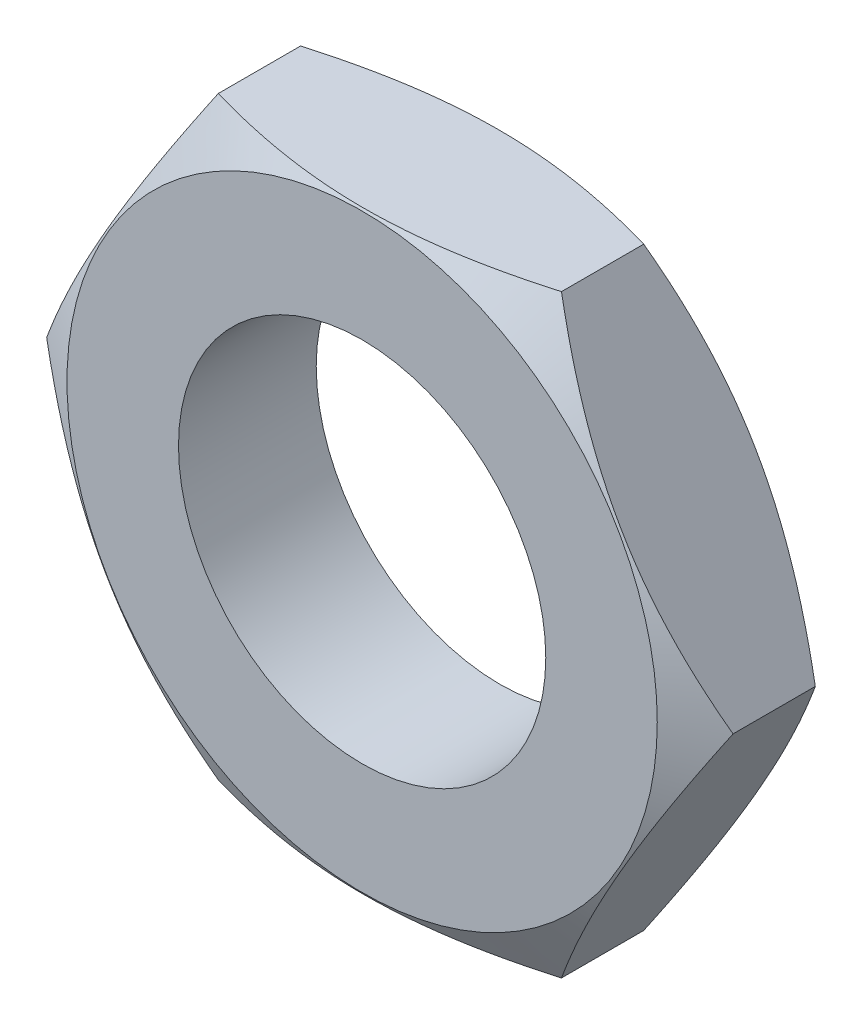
ISO-10303-21;
HEADER;
FILE_DESCRIPTION(('STEP AP214'),'2;1');
FILE_NAME('part.step','',(''),(''),'','','');
FILE_SCHEMA(('AUTOMOTIVE_DESIGN { 1 0 10303 214 1 1 1 1 }'));
ENDSEC;
DATA;
#1=APPLICATION_CONTEXT('core data for automotive mechanical design processes');
#2=APPLICATION_PROTOCOL_DEFINITION('international standard','automotive_design',2000,#1);
#3=PRODUCT_CONTEXT('',#1,'mechanical');
#4=PRODUCT('Part','Part','',(#3));
#5=PRODUCT_RELATED_PRODUCT_CATEGORY('part','',(#4));
#6=PRODUCT_DEFINITION_FORMATION('','',#4);
#7=PRODUCT_DEFINITION_CONTEXT('part definition',#1,'design');
#8=PRODUCT_DEFINITION('design','',#6,#7);
#9=PRODUCT_DEFINITION_SHAPE('','',#8);
#10=(LENGTH_UNIT() NAMED_UNIT(*) SI_UNIT(.MILLI.,.METRE.));
#11=(NAMED_UNIT(*) PLANE_ANGLE_UNIT() SI_UNIT($,.RADIAN.));
#12=(NAMED_UNIT(*) SI_UNIT($,.STERADIAN.) SOLID_ANGLE_UNIT());
#13=UNCERTAINTY_MEASURE_WITH_UNIT(LENGTH_MEASURE(1.E-05),#10,'distance_accuracy_value','');
#14=(GEOMETRIC_REPRESENTATION_CONTEXT(3) GLOBAL_UNCERTAINTY_ASSIGNED_CONTEXT((#13)) GLOBAL_UNIT_ASSIGNED_CONTEXT((#10,
#11,#12)) REPRESENTATION_CONTEXT('',''));
#15=CARTESIAN_POINT('',(0.,0.,0.));
#16=DIRECTION('',(0.,0.,1.));
#17=DIRECTION('',(1.,0.,0.));
#18=AXIS2_PLACEMENT_3D('',#15,#16,#17);
#19=CARTESIAN_POINT('',(0.,0.,0.604197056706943));
#20=DIRECTION('',(0.,0.,1.));
#21=DIRECTION('',(1.,0.,0.));
#22=AXIS2_PLACEMENT_3D('',#19,#20,#21);
#23=CONICAL_SURFACE('',#22,7.475,1.0471975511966);
#24=CARTESIAN_POINT('',(0.,0.,0.));
#25=DIRECTION('',(0.,0.,1.));
#26=DIRECTION('',(1.,0.,0.));
#27=AXIS2_PLACEMENT_3D('',#24,#25,#26);
#28=CIRCLE('',#27,6.4285);
#29=CARTESIAN_POINT('',(6.4285,0.,0.));
#30=VERTEX_POINT('',#29);
#31=EDGE_CURVE('E214',#30,#30,#28,.F.);
#32=ORIENTED_EDGE('',*,*,#31,.F.);
#33=EDGE_LOOP('',(#32));
#34=FACE_BOUND('',#33,.T.);
#35=CARTESIAN_POINT('',(3.73738452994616,6.47373989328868,0.604263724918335));
#36=CARTESIAN_POINT('',(3.8195390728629,6.33144405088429,0.556838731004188));
#37=CARTESIAN_POINT('',(3.90199992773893,6.18861766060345,0.511566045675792));
#38=CARTESIAN_POINT('',(4.06759130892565,5.90180497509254,0.425918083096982));
#39=CARTESIAN_POINT('',(4.15072210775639,5.75781820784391,0.38554491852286));
#40=CARTESIAN_POINT('',(4.40144553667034,5.32355249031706,0.272567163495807));
#41=CARTESIAN_POINT('',(4.57002785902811,5.03155934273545,0.208306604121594));
#42=CARTESIAN_POINT('',(4.82230823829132,4.59459690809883,0.132953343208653));
#43=CARTESIAN_POINT('',(4.90525250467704,4.45093322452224,0.111487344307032));
#44=CARTESIAN_POINT('',(5.07151582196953,4.16295671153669,0.0754919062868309));
#45=CARTESIAN_POINT('',(5.15483483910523,4.01864394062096,0.060961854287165));
#46=CARTESIAN_POINT('',(5.32161758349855,3.72976775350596,0.0392086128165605));
#47=CARTESIAN_POINT('',(5.40508103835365,3.58520480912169,0.0319771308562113));
#48=CARTESIAN_POINT('',(5.57208044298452,3.29595335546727,0.0249683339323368));
#49=CARTESIAN_POINT('',(5.65561639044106,3.15126485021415,0.0251907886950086));
#50=CARTESIAN_POINT('',(5.88447837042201,2.75486427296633,0.0360461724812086));
#51=CARTESIAN_POINT('',(6.02972948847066,2.50328195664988,0.0542700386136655));
#52=CARTESIAN_POINT('',(6.31926697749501,2.00178831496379,0.112058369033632));
#53=CARTESIAN_POINT('',(6.46355233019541,1.7518787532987,0.151642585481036));
#54=CARTESIAN_POINT('',(6.75367252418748,1.2493758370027,0.250591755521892));
#55=CARTESIAN_POINT('',(6.89947075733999,0.996845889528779,0.310375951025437));
#56=CARTESIAN_POINT('',(7.18889294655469,0.495551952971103,0.446061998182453));
#57=CARTESIAN_POINT('',(7.33252060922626,0.246781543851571,0.521931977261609));
#58=CARTESIAN_POINT('',(7.47511547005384,-0.00019999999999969,0.604263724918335));
#59=B_SPLINE_CURVE_WITH_KNOTS('',3,(#35,#36,#37,#38,#39,#40,#41,#42,#43,#44,#45,#46,#47,#48,#49,
#50,#51,#52,#53,#54,#55,#56,#57,#58),.UNSPECIFIED.,.F.,.F.,(4,2,2,2,2,2,2,2,2,2,2,4),(0.,
0.513008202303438,1.02623683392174,2.05482672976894,2.55652445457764,3.05817783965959,
3.55926061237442,4.06032790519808,4.93263244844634,5.80574500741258,6.69822217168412,
7.58894722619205),.UNSPECIFIED.);
#60=CARTESIAN_POINT('',(3.7375,6.47353989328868,0.604197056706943));
#61=VERTEX_POINT('',#60);
#62=CARTESIAN_POINT('',(7.475,0.,0.604197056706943));
#63=VERTEX_POINT('',#62);
#64=EDGE_CURVE('E90',#61,#63,#59,.T.);
#65=ORIENTED_EDGE('',*,*,#64,.T.);
#66=CARTESIAN_POINT('',(7.47511547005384,0.0002,0.604263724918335));
#67=CARTESIAN_POINT('',(7.3929609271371,-0.142095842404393,0.556838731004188));
#68=CARTESIAN_POINT('',(7.31050007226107,-0.28492223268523,0.511566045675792));
#69=CARTESIAN_POINT('',(7.14490869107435,-0.571734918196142,0.425918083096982));
#70=CARTESIAN_POINT('',(7.06177789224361,-0.715721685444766,0.38554491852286));
#71=CARTESIAN_POINT('',(6.81105446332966,-1.14998740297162,0.272567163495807));
#72=CARTESIAN_POINT('',(6.64247214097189,-1.44198055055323,0.208306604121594));
#73=CARTESIAN_POINT('',(6.39019176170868,-1.87894298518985,0.132953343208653));
#74=CARTESIAN_POINT('',(6.30724749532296,-2.02260666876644,0.111487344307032));
#75=CARTESIAN_POINT('',(6.14098417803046,-2.31058318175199,0.0754919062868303));
#76=CARTESIAN_POINT('',(6.05766516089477,-2.45489595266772,0.0609618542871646));
#77=CARTESIAN_POINT('',(5.89088241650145,-2.74377213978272,0.0392086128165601));
#78=CARTESIAN_POINT('',(5.80741896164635,-2.88833508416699,0.0319771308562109));
#79=CARTESIAN_POINT('',(5.64041955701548,-3.1775865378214,0.0249683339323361));
#80=CARTESIAN_POINT('',(5.55688360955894,-3.32227504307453,0.0251907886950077));
#81=CARTESIAN_POINT('',(5.32802162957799,-3.71867562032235,0.0360461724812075));
#82=CARTESIAN_POINT('',(5.18277051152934,-3.97025793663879,0.0542700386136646));
#83=CARTESIAN_POINT('',(4.89323302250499,-4.47175157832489,0.112058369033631));
#84=CARTESIAN_POINT('',(4.74894766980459,-4.72166113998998,0.151642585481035));
#85=CARTESIAN_POINT('',(4.45882747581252,-5.22416405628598,0.250591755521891));
#86=CARTESIAN_POINT('',(4.31302924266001,-5.4766940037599,0.310375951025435));
#87=CARTESIAN_POINT('',(4.02360705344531,-5.97798794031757,0.446061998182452));
#88=CARTESIAN_POINT('',(3.87997939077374,-6.22675834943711,0.521931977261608));
#89=CARTESIAN_POINT('',(3.73738452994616,-6.47373989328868,0.604263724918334));
#90=B_SPLINE_CURVE_WITH_KNOTS('',3,(#66,#67,#68,#69,#70,#71,#72,#73,#74,#75,#76,#77,#78,#79,#80,
#81,#82,#83,#84,#85,#86,#87,#88,#89),.UNSPECIFIED.,.F.,.F.,(4,2,2,2,2,2,2,2,2,2,2,4),(0.,
0.513008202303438,1.02623683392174,2.05482672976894,2.55652445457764,3.05817783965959,
3.55926061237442,4.06032790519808,4.93263244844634,5.80574500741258,6.69822217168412,
7.58894722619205),.UNSPECIFIED.);
#91=CARTESIAN_POINT('',(3.7375,-6.47353989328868,0.604197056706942));
#92=VERTEX_POINT('',#91);
#93=EDGE_CURVE('E179',#63,#92,#90,.T.);
#94=ORIENTED_EDGE('',*,*,#93,.T.);
#95=CARTESIAN_POINT('',(-9.90879448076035,-6.47353989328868,3.12202233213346));
#96=CARTESIAN_POINT('',(-9.62459753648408,-6.47353989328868,2.984697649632));
#97=CARTESIAN_POINT('',(-9.33972824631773,-6.47353989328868,2.84873919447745));
#98=CARTESIAN_POINT('',(-8.7682814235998,-6.47353989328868,2.58033553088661));
#99=CARTESIAN_POINT('',(-8.48170360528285,-6.47353989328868,2.44789093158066));
#100=CARTESIAN_POINT('',(-7.90492632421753,-6.47353989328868,2.18659725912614));
#101=CARTESIAN_POINT('',(-7.61471551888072,-6.47353989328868,2.05777313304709));
#102=CARTESIAN_POINT('',(-7.03190728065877,-6.47353989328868,1.80566339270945));
#103=CARTESIAN_POINT('',(-6.73930997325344,-6.47353989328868,1.68237748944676));
#104=CARTESIAN_POINT('',(-6.14764786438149,-6.47353989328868,1.44136024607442));
#105=CARTESIAN_POINT('',(-5.84854772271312,-6.47353989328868,1.32371518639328));
#106=CARTESIAN_POINT('',(-5.24681801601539,-6.47353989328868,1.09764807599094));
#107=CARTESIAN_POINT('',(-4.94418806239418,-6.47353989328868,0.989227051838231));
#108=CARTESIAN_POINT('',(-4.33554111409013,-6.47353989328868,0.784523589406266));
#109=CARTESIAN_POINT('',(-4.02953289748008,-6.47353989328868,0.688215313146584));
#110=CARTESIAN_POINT('',(-3.41316316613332,-6.47353989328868,0.510868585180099));
#111=CARTESIAN_POINT('',(-3.10280306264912,-6.47353989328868,0.429825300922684));
#112=CARTESIAN_POINT('',(-2.47753104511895,-6.47353989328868,0.286940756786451));
#113=CARTESIAN_POINT('',(-2.16261789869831,-6.47353989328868,0.225104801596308));
#114=CARTESIAN_POINT('',(-1.52895478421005,-6.47353989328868,0.124816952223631));
#115=CARTESIAN_POINT('',(-1.21020481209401,-6.47353989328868,0.0863650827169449));
#116=CARTESIAN_POINT('',(-0.731574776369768,-6.47353989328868,0.0486903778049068));
#117=CARTESIAN_POINT('',(-0.572441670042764,-6.47353989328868,0.0394639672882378));
#118=CARTESIAN_POINT('',(-0.253920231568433,-6.47353989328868,0.02775387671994));
#119=CARTESIAN_POINT('',(-0.0945319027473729,-6.47353989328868,0.0252701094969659));
#120=CARTESIAN_POINT('',(0.224159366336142,-6.47353989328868,0.0271121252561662));
#121=CARTESIAN_POINT('',(0.383462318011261,-6.47353989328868,0.0314360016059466));
#122=CARTESIAN_POINT('',(0.70174773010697,-6.47353989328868,0.0467838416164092));
#123=CARTESIAN_POINT('',(0.860730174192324,-6.47353989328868,0.0578081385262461));
#124=CARTESIAN_POINT('',(1.24617044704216,-6.47353989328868,0.0924289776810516));
#125=CARTESIAN_POINT('',(1.47233101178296,-6.47353989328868,0.119389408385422));
#126=CARTESIAN_POINT('',(1.9229167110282,-6.47353989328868,0.185372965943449));
#127=CARTESIAN_POINT('',(2.14734135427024,-6.47353989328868,0.22439938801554));
#128=CARTESIAN_POINT('',(2.59427080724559,-6.47353989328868,0.313130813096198));
#129=CARTESIAN_POINT('',(2.81677359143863,-6.47353989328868,0.362845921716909));
#130=CARTESIAN_POINT('',(3.25948878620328,-6.47353989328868,0.471438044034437));
#131=CARTESIAN_POINT('',(3.47970141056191,-6.47353989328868,0.530314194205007));
#132=CARTESIAN_POINT('',(3.92325507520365,-6.47353989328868,0.657357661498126));
#133=CARTESIAN_POINT('',(4.14654068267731,-6.47353989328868,0.72571718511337));
#134=CARTESIAN_POINT('',(4.59075168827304,-6.47353989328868,0.869182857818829));
#135=CARTESIAN_POINT('',(4.81167859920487,-6.47353989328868,0.944284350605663));
#136=CARTESIAN_POINT('',(5.25028564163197,-6.47353989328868,1.09968331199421));
#137=CARTESIAN_POINT('',(5.46797705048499,-6.47353989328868,1.17994914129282));
#138=CARTESIAN_POINT('',(5.9016715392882,-6.47353989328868,1.3451869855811));
#139=CARTESIAN_POINT('',(6.11767389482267,-6.47353989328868,1.43016090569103));
#140=CARTESIAN_POINT('',(6.33289187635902,-6.47353989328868,1.51702296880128));
#141=B_SPLINE_CURVE_WITH_KNOTS('',3,(#95,#96,#97,#98,#99,#100,#101,#102,#103,#104,#105,#106,
#107,#108,#109,#110,#111,#112,#113,#114,#115,#116,#117,#118,#119,#120,#121,#122,#123,#124,#125,
#126,#127,#128,#129,#130,#131,#132,#133,#134,#135,#136,#137,#138,#139,#140),.UNSPECIFIED.,.F.,
.F.,(4,2,2,2,2,2,2,2,2,2,2,2,2,2,2,2,2,2,2,2,2,2,4),(0.,0.946920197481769,1.89400348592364,
2.84651285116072,3.79897245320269,4.76307039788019,5.72727549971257,6.68938763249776,
7.65119466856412,8.61326710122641,9.57534054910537,10.053420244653,10.5314937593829,
11.0094334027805,11.4873968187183,12.1703018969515,12.8533936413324,13.5371340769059,
14.2208101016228,14.9212269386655,15.6211637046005,16.3171591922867,17.0134383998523),.UNSPECIFIED.);
#142=CARTESIAN_POINT('',(-3.7375,-6.47353989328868,0.604197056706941));
#143=VERTEX_POINT('',#142);
#144=EDGE_CURVE('E173',#92,#143,#141,.F.);
#145=ORIENTED_EDGE('',*,*,#144,.T.);
#146=CARTESIAN_POINT('',(-3.73738452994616,-6.47373989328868,0.604263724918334));
#147=CARTESIAN_POINT('',(-3.8195390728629,-6.33144405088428,0.556838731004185));
#148=CARTESIAN_POINT('',(-3.90199992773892,-6.18861766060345,0.51156604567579));
#149=CARTESIAN_POINT('',(-4.06759130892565,-5.90180497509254,0.42591808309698));
#150=CARTESIAN_POINT('',(-4.15072210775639,-5.75781820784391,0.385544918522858));
#151=CARTESIAN_POINT('',(-4.40144553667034,-5.32355249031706,0.272567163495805));
#152=CARTESIAN_POINT('',(-4.57002785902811,-5.03155934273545,0.208306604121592));
#153=CARTESIAN_POINT('',(-4.82230823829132,-4.59459690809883,0.132953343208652));
#154=CARTESIAN_POINT('',(-4.90525250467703,-4.45093322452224,0.111487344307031));
#155=CARTESIAN_POINT('',(-5.07151582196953,-4.16295671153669,0.0754919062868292));
#156=CARTESIAN_POINT('',(-5.15483483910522,-4.01864394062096,0.0609618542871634));
#157=CARTESIAN_POINT('',(-5.32161758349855,-3.72976775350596,0.0392086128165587));
#158=CARTESIAN_POINT('',(-5.40508103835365,-3.58520480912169,0.0319771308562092));
#159=CARTESIAN_POINT('',(-5.57208044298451,-3.29595335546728,0.0249683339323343));
#160=CARTESIAN_POINT('',(-5.65561639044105,-3.15126485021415,0.0251907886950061));
#161=CARTESIAN_POINT('',(-5.884478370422,-2.75486427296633,0.0360461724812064));
#162=CARTESIAN_POINT('',(-6.02972948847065,-2.50328195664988,0.0542700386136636));
#163=CARTESIAN_POINT('',(-6.31926697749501,-2.00178831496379,0.11205836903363));
#164=CARTESIAN_POINT('',(-6.46355233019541,-1.7518787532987,0.151642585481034));
#165=CARTESIAN_POINT('',(-6.75367252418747,-1.2493758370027,0.25059175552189));
#166=CARTESIAN_POINT('',(-6.89947075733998,-0.99684588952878,0.310375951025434));
#167=CARTESIAN_POINT('',(-7.18889294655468,-0.495551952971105,0.44606199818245));
#168=CARTESIAN_POINT('',(-7.33252060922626,-0.246781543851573,0.521931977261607));
#169=CARTESIAN_POINT('',(-7.47511547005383,0.000199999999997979,0.604263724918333));
#170=B_SPLINE_CURVE_WITH_KNOTS('',3,(#146,#147,#148,#149,#150,#151,#152,#153,#154,#155,#156,
#157,#158,#159,#160,#161,#162,#163,#164,#165,#166,#167,#168,#169),.UNSPECIFIED.,.F.,.F.,(4,2,2,
2,2,2,2,2,2,2,2,4),(0.,0.513008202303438,1.02623683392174,2.05482672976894,2.55652445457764,
3.05817783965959,3.55926061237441,4.06032790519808,4.93263244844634,5.80574500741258,
6.69822217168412,7.58894722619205),.UNSPECIFIED.);
#171=CARTESIAN_POINT('',(-7.475,0.,0.60419705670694));
#172=VERTEX_POINT('',#171);
#173=EDGE_CURVE('E111',#143,#172,#170,.T.);
#174=ORIENTED_EDGE('',*,*,#173,.T.);
#175=CARTESIAN_POINT('',(-7.47511547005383,-0.000200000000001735,0.604263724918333));
#176=CARTESIAN_POINT('',(-7.39296092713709,0.142095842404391,0.556838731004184));
#177=CARTESIAN_POINT('',(-7.31050007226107,0.284922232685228,0.511566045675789));
#178=CARTESIAN_POINT('',(-7.14490869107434,0.57173491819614,0.425918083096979));
#179=CARTESIAN_POINT('',(-7.06177789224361,0.715721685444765,0.385544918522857));
#180=CARTESIAN_POINT('',(-6.81105446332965,1.14998740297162,0.272567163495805));
#181=CARTESIAN_POINT('',(-6.64247214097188,1.44198055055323,0.208306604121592));
#182=CARTESIAN_POINT('',(-6.39019176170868,1.87894298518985,0.132953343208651));
#183=CARTESIAN_POINT('',(-6.30724749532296,2.02260666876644,0.11148734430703));
#184=CARTESIAN_POINT('',(-6.14098417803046,2.31058318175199,0.0754919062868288));
#185=CARTESIAN_POINT('',(-6.05766516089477,2.45489595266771,0.0609618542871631));
#186=CARTESIAN_POINT('',(-5.89088241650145,2.74377213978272,0.0392086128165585));
#187=CARTESIAN_POINT('',(-5.80741896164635,2.88833508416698,0.031977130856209));
#188=CARTESIAN_POINT('',(-5.64041955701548,3.1775865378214,0.0249683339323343));
#189=CARTESIAN_POINT('',(-5.55688360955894,3.32227504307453,0.0251907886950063));
#190=CARTESIAN_POINT('',(-5.32802162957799,3.71867562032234,0.0360461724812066));
#191=CARTESIAN_POINT('',(-5.18277051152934,3.97025793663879,0.0542700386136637));
#192=CARTESIAN_POINT('',(-4.89323302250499,4.47175157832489,0.11205836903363));
#193=CARTESIAN_POINT('',(-4.74894766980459,4.72166113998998,0.151642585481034));
#194=CARTESIAN_POINT('',(-4.45882747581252,5.22416405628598,0.25059175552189));
#195=CARTESIAN_POINT('',(-4.31302924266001,5.4766940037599,0.310375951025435));
#196=CARTESIAN_POINT('',(-4.02360705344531,5.97798794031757,0.446061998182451));
#197=CARTESIAN_POINT('',(-3.87997939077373,6.22675834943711,0.521931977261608));
#198=CARTESIAN_POINT('',(-3.73738452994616,6.47373989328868,0.604263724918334));
#199=B_SPLINE_CURVE_WITH_KNOTS('',3,(#175,#176,#177,#178,#179,#180,#181,#182,#183,#184,#185,
#186,#187,#188,#189,#190,#191,#192,#193,#194,#195,#196,#197,#198),.UNSPECIFIED.,.F.,.F.,(4,2,2,
2,2,2,2,2,2,2,2,4),(0.,0.513008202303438,1.02623683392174,2.05482672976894,2.55652445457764,
3.05817783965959,3.55926061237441,4.06032790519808,4.93263244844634,5.80574500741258,
6.69822217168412,7.58894722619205),.UNSPECIFIED.);
#200=CARTESIAN_POINT('',(-3.7375,6.47353989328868,0.604197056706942));
#201=VERTEX_POINT('',#200);
#202=EDGE_CURVE('E109',#172,#201,#199,.T.);
#203=ORIENTED_EDGE('',*,*,#202,.T.);
#204=CARTESIAN_POINT('',(-9.90879448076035,6.47353989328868,3.12202233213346));
#205=CARTESIAN_POINT('',(-9.62459753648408,6.47353989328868,2.98469764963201));
#206=CARTESIAN_POINT('',(-9.33972824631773,6.47353989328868,2.84873919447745));
#207=CARTESIAN_POINT('',(-8.76828142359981,6.47353989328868,2.58033553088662));
#208=CARTESIAN_POINT('',(-8.48170360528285,6.47353989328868,2.44789093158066));
#209=CARTESIAN_POINT('',(-7.90492632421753,6.47353989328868,2.18659725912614));
#210=CARTESIAN_POINT('',(-7.61471551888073,6.47353989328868,2.05777313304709));
#211=CARTESIAN_POINT('',(-7.03190728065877,6.47353989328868,1.80566339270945));
#212=CARTESIAN_POINT('',(-6.73930997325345,6.47353989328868,1.68237748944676));
#213=CARTESIAN_POINT('',(-6.14764786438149,6.47353989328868,1.44136024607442));
#214=CARTESIAN_POINT('',(-5.84854772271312,6.47353989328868,1.32371518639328));
#215=CARTESIAN_POINT('',(-5.24681801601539,6.47353989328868,1.09764807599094));
#216=CARTESIAN_POINT('',(-4.94418806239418,6.47353989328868,0.989227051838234));
#217=CARTESIAN_POINT('',(-4.33554111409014,6.47353989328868,0.784523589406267));
#218=CARTESIAN_POINT('',(-4.02953289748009,6.47353989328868,0.688215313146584));
#219=CARTESIAN_POINT('',(-3.41316316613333,6.47353989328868,0.510868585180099));
#220=CARTESIAN_POINT('',(-3.10280306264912,6.47353989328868,0.429825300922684));
#221=CARTESIAN_POINT('',(-2.47753104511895,6.47353989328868,0.286940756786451));
#222=CARTESIAN_POINT('',(-2.16261789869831,6.47353989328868,0.225104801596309));
#223=CARTESIAN_POINT('',(-1.52895478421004,6.47353989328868,0.124816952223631));
#224=CARTESIAN_POINT('',(-1.21020481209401,6.47353989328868,0.0863650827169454));
#225=CARTESIAN_POINT('',(-0.731574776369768,6.47353989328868,0.0486903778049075));
#226=CARTESIAN_POINT('',(-0.572441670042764,6.47353989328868,0.0394639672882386));
#227=CARTESIAN_POINT('',(-0.253920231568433,6.47353989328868,0.0277538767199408));
#228=CARTESIAN_POINT('',(-0.0945319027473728,6.47353989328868,0.0252701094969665));
#229=CARTESIAN_POINT('',(0.224159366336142,6.47353989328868,0.0271121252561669));
#230=CARTESIAN_POINT('',(0.383462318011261,6.47353989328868,0.0314360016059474));
#231=CARTESIAN_POINT('',(0.70174773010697,6.47353989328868,0.0467838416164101));
#232=CARTESIAN_POINT('',(0.860730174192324,6.47353989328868,0.0578081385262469));
#233=CARTESIAN_POINT('',(1.24617044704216,6.47353989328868,0.0924289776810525));
#234=CARTESIAN_POINT('',(1.47233101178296,6.47353989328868,0.119389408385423));
#235=CARTESIAN_POINT('',(1.9229167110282,6.47353989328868,0.185372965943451));
#236=CARTESIAN_POINT('',(2.14734135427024,6.47353989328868,0.224399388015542));
#237=CARTESIAN_POINT('',(2.59427080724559,6.47353989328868,0.3131308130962));
#238=CARTESIAN_POINT('',(2.81677359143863,6.47353989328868,0.362845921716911));
#239=CARTESIAN_POINT('',(3.25948878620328,6.47353989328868,0.471438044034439));
#240=CARTESIAN_POINT('',(3.47970141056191,6.47353989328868,0.530314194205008));
#241=CARTESIAN_POINT('',(3.92325507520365,6.47353989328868,0.657357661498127));
#242=CARTESIAN_POINT('',(4.14654068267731,6.47353989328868,0.725717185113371));
#243=CARTESIAN_POINT('',(4.59075168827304,6.47353989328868,0.869182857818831));
#244=CARTESIAN_POINT('',(4.81167859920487,6.47353989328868,0.944284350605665));
#245=CARTESIAN_POINT('',(5.25028564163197,6.47353989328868,1.09968331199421));
#246=CARTESIAN_POINT('',(5.46797705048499,6.47353989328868,1.17994914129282));
#247=CARTESIAN_POINT('',(5.9016715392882,6.47353989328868,1.3451869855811));
#248=CARTESIAN_POINT('',(6.11767389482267,6.47353989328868,1.43016090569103));
#249=CARTESIAN_POINT('',(6.33289187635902,6.47353989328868,1.51702296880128));
#250=B_SPLINE_CURVE_WITH_KNOTS('',3,(#204,#205,#206,#207,#208,#209,#210,#211,#212,#213,#214,
#215,#216,#217,#218,#219,#220,#221,#222,#223,#224,#225,#226,#227,#228,#229,#230,#231,#232,#233,
#234,#235,#236,#237,#238,#239,#240,#241,#242,#243,#244,#245,#246,#247,#248,#249),.UNSPECIFIED.,
.F.,.F.,(4,2,2,2,2,2,2,2,2,2,2,2,2,2,2,2,2,2,2,2,2,2,4),(0.,0.946920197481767,1.89400348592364,
2.84651285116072,3.79897245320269,4.76307039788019,5.72727549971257,6.68938763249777,
7.65119466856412,8.61326710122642,9.57534054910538,10.053420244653,10.5314937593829,
11.0094334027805,11.4873968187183,12.1703018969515,12.8533936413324,13.5371340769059,
14.2208101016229,14.9212269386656,15.6211637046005,16.3171591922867,17.0134383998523),.UNSPECIFIED.);
#251=EDGE_CURVE('E95',#201,#61,#250,.T.);
#252=ORIENTED_EDGE('',*,*,#251,.T.);
#253=EDGE_LOOP('',(#65,#94,#145,#174,#203,#252));
#254=FACE_BOUND('',#253,.T.);
#255=ADVANCED_FACE('F35',(#34,#254),#23,.T.);
#256=CARTESIAN_POINT('',(0.,0.,3.));
#257=DIRECTION('',(0.,0.,-1.));
#258=DIRECTION('',(-1.,0.,0.));
#259=AXIS2_PLACEMENT_3D('',#256,#257,#258);
#260=CONICAL_SURFACE('',#259,6.4285,1.0471975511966);
#261=CARTESIAN_POINT('',(0.,0.,3.));
#262=DIRECTION('',(0.,0.,1.));
#263=DIRECTION('',(1.,0.,0.));
#264=AXIS2_PLACEMENT_3D('',#261,#262,#263);
#265=CIRCLE('',#264,6.4285);
#266=CARTESIAN_POINT('',(6.4285,0.,3.));
#267=VERTEX_POINT('',#266);
#268=EDGE_CURVE('E215',#267,#267,#265,.T.);
#269=ORIENTED_EDGE('',*,*,#268,.F.);
#270=EDGE_LOOP('',(#269));
#271=FACE_BOUND('',#270,.T.);
#272=CARTESIAN_POINT('',(-9.90879448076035,-6.47353989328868,-0.122022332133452));
#273=CARTESIAN_POINT('',(-9.62459753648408,-6.47353989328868,0.0153023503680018));
#274=CARTESIAN_POINT('',(-9.33972824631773,-6.47353989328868,0.151260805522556));
#275=CARTESIAN_POINT('',(-8.76828142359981,-6.47353989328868,0.41966446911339));
#276=CARTESIAN_POINT('',(-8.48170360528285,-6.47353989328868,0.552109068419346));
#277=CARTESIAN_POINT('',(-7.90492632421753,-6.47353989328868,0.813402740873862));
#278=CARTESIAN_POINT('',(-7.61471551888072,-6.47353989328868,0.942226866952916));
#279=CARTESIAN_POINT('',(-7.03190728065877,-6.47353989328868,1.19433660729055));
#280=CARTESIAN_POINT('',(-6.73930997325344,-6.47353989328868,1.31762251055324));
#281=CARTESIAN_POINT('',(-6.14764786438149,-6.47353989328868,1.55863975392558));
#282=CARTESIAN_POINT('',(-5.84854772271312,-6.47353989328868,1.67628481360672));
#283=CARTESIAN_POINT('',(-5.24681801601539,-6.47353989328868,1.90235192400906));
#284=CARTESIAN_POINT('',(-4.94418806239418,-6.47353989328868,2.01077294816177));
#285=CARTESIAN_POINT('',(-4.33554111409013,-6.47353989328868,2.21547641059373));
#286=CARTESIAN_POINT('',(-4.02953289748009,-6.47353989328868,2.31178468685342));
#287=CARTESIAN_POINT('',(-3.41316316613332,-6.47353989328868,2.4891314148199));
#288=CARTESIAN_POINT('',(-3.10280306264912,-6.47353989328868,2.57017469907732));
#289=CARTESIAN_POINT('',(-2.47753104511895,-6.47353989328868,2.71305924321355));
#290=CARTESIAN_POINT('',(-2.16261789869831,-6.47353989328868,2.77489519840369));
#291=CARTESIAN_POINT('',(-1.52895478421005,-6.47353989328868,2.87518304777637));
#292=CARTESIAN_POINT('',(-1.21020481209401,-6.47353989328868,2.91363491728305));
#293=CARTESIAN_POINT('',(-0.731574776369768,-6.47353989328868,2.95130962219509));
#294=CARTESIAN_POINT('',(-0.572441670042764,-6.47353989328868,2.96053603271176));
#295=CARTESIAN_POINT('',(-0.253920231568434,-6.47353989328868,2.97224612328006));
#296=CARTESIAN_POINT('',(-0.0945319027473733,-6.47353989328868,2.97472989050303));
#297=CARTESIAN_POINT('',(0.224159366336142,-6.47353989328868,2.97288787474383));
#298=CARTESIAN_POINT('',(0.383462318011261,-6.47353989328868,2.96856399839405));
#299=CARTESIAN_POINT('',(0.701747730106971,-6.47353989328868,2.95321615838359));
#300=CARTESIAN_POINT('',(0.860730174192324,-6.47353989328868,2.94219186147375));
#301=CARTESIAN_POINT('',(1.24617044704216,-6.47353989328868,2.90757102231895));
#302=CARTESIAN_POINT('',(1.47233101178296,-6.47353989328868,2.88061059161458));
#303=CARTESIAN_POINT('',(1.92291671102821,-6.47353989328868,2.81462703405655));
#304=CARTESIAN_POINT('',(2.14734135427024,-6.47353989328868,2.77560061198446));
#305=CARTESIAN_POINT('',(2.59427080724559,-6.47353989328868,2.6868691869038));
#306=CARTESIAN_POINT('',(2.81677359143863,-6.47353989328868,2.63715407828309));
#307=CARTESIAN_POINT('',(3.25948878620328,-6.47353989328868,2.52856195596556));
#308=CARTESIAN_POINT('',(3.47970141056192,-6.47353989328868,2.46968580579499));
#309=CARTESIAN_POINT('',(3.92325507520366,-6.47353989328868,2.34264233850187));
#310=CARTESIAN_POINT('',(4.14654068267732,-6.47353989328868,2.27428281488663));
#311=CARTESIAN_POINT('',(4.59075168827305,-6.47353989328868,2.13081714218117));
#312=CARTESIAN_POINT('',(4.81167859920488,-6.47353989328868,2.05571564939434));
#313=CARTESIAN_POINT('',(5.25028564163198,-6.47353989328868,1.90031668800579));
#314=CARTESIAN_POINT('',(5.467977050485,-6.47353989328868,1.82005085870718));
#315=CARTESIAN_POINT('',(5.90167153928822,-6.47353989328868,1.65481301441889));
#316=CARTESIAN_POINT('',(6.11767389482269,-6.47353989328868,1.56983909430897));
#317=CARTESIAN_POINT('',(6.33289187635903,-6.47353989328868,1.48297703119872));
#318=B_SPLINE_CURVE_WITH_KNOTS('',3,(#272,#273,#274,#275,#276,#277,#278,#279,#280,#281,#282,
#283,#284,#285,#286,#287,#288,#289,#290,#291,#292,#293,#294,#295,#296,#297,#298,#299,#300,#301,
#302,#303,#304,#305,#306,#307,#308,#309,#310,#311,#312,#313,#314,#315,#316,#317),.UNSPECIFIED.,
.F.,.F.,(4,2,2,2,2,2,2,2,2,2,2,2,2,2,2,2,2,2,2,2,2,2,4),(0.,0.946920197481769,1.89400348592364,
2.84651285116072,3.79897245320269,4.76307039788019,5.72727549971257,6.68938763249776,
7.65119466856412,8.61326710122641,9.57534054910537,10.053420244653,10.5314937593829,
11.0094334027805,11.4873968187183,12.1703018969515,12.8533936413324,13.5371340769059,
14.2208101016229,14.9212269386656,15.6211637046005,16.3171591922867,17.0134383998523),.UNSPECIFIED.);
#319=CARTESIAN_POINT('',(-3.7375,-6.47353989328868,2.39580294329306));
#320=VERTEX_POINT('',#319);
#321=CARTESIAN_POINT('',(3.7375,-6.47353989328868,2.39580294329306));
#322=VERTEX_POINT('',#321);
#323=EDGE_CURVE('E48',#320,#322,#318,.T.);
#324=ORIENTED_EDGE('',*,*,#323,.T.);
#325=CARTESIAN_POINT('',(3.73738452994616,-6.47373989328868,2.39573627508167));
#326=CARTESIAN_POINT('',(3.8195390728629,-6.33144405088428,2.44316126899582));
#327=CARTESIAN_POINT('',(3.90199992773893,-6.18861766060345,2.48843395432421));
#328=CARTESIAN_POINT('',(4.06759130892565,-5.90180497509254,2.57408191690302));
#329=CARTESIAN_POINT('',(4.15072210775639,-5.75781820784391,2.61445508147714));
#330=CARTESIAN_POINT('',(4.40144553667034,-5.32355249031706,2.72743283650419));
#331=CARTESIAN_POINT('',(4.57002785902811,-5.03155934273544,2.79169339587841));
#332=CARTESIAN_POINT('',(4.82230823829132,-4.59459690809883,2.86704665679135));
#333=CARTESIAN_POINT('',(4.90525250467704,-4.45093322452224,2.88851265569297));
#334=CARTESIAN_POINT('',(5.07151582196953,-4.16295671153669,2.92450809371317));
#335=CARTESIAN_POINT('',(5.15483483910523,-4.01864394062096,2.93903814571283));
#336=CARTESIAN_POINT('',(5.32161758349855,-3.72976775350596,2.96079138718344));
#337=CARTESIAN_POINT('',(5.40508103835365,-3.58520480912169,2.96802286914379));
#338=CARTESIAN_POINT('',(5.57208044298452,-3.29595335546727,2.97503166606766));
#339=CARTESIAN_POINT('',(5.65561639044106,-3.15126485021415,2.97480921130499));
#340=CARTESIAN_POINT('',(5.884478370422,-2.75486427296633,2.96395382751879));
#341=CARTESIAN_POINT('',(6.02972948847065,-2.50328195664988,2.94572996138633));
#342=CARTESIAN_POINT('',(6.31926697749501,-2.00178831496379,2.88794163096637));
#343=CARTESIAN_POINT('',(6.46355233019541,-1.7518787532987,2.84835741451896));
#344=CARTESIAN_POINT('',(6.75367252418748,-1.2493758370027,2.74940824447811));
#345=CARTESIAN_POINT('',(6.89947075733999,-0.996845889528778,2.68962404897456));
#346=CARTESIAN_POINT('',(7.18889294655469,-0.495551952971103,2.55393800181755));
#347=CARTESIAN_POINT('',(7.33252060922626,-0.246781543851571,2.47806802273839));
#348=CARTESIAN_POINT('',(7.47511547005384,0.000200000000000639,2.39573627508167));
#349=B_SPLINE_CURVE_WITH_KNOTS('',3,(#325,#326,#327,#328,#329,#330,#331,#332,#333,#334,#335,
#336,#337,#338,#339,#340,#341,#342,#343,#344,#345,#346,#347,#348),.UNSPECIFIED.,.F.,.F.,(4,2,2,
2,2,2,2,2,2,2,2,4),(0.,0.513008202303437,1.02623683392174,2.05482672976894,2.55652445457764,
3.05817783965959,3.55926061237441,4.06032790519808,4.93263244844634,5.80574500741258,
6.69822217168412,7.58894722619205),.UNSPECIFIED.);
#350=CARTESIAN_POINT('',(7.475,0.,2.39580294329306));
#351=VERTEX_POINT('',#350);
#352=EDGE_CURVE('E12',#322,#351,#349,.T.);
#353=ORIENTED_EDGE('',*,*,#352,.T.);
#354=CARTESIAN_POINT('',(7.47511547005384,-0.000200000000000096,2.39573627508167));
#355=CARTESIAN_POINT('',(7.3929609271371,0.142095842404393,2.44316126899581));
#356=CARTESIAN_POINT('',(7.31050007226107,0.28492223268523,2.48843395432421));
#357=CARTESIAN_POINT('',(7.14490869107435,0.571734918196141,2.57408191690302));
#358=CARTESIAN_POINT('',(7.06177789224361,0.715721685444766,2.61445508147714));
#359=CARTESIAN_POINT('',(6.81105446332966,1.14998740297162,2.72743283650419));
#360=CARTESIAN_POINT('',(6.64247214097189,1.44198055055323,2.79169339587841));
#361=CARTESIAN_POINT('',(6.39019176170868,1.87894298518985,2.86704665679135));
#362=CARTESIAN_POINT('',(6.30724749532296,2.02260666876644,2.88851265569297));
#363=CARTESIAN_POINT('',(6.14098417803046,2.31058318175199,2.92450809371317));
#364=CARTESIAN_POINT('',(6.05766516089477,2.45489595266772,2.93903814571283));
#365=CARTESIAN_POINT('',(5.89088241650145,2.74377213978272,2.96079138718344));
#366=CARTESIAN_POINT('',(5.80741896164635,2.88833508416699,2.96802286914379));
#367=CARTESIAN_POINT('',(5.64041955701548,3.1775865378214,2.97503166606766));
#368=CARTESIAN_POINT('',(5.55688360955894,3.32227504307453,2.97480921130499));
#369=CARTESIAN_POINT('',(5.32802162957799,3.71867562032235,2.96395382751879));
#370=CARTESIAN_POINT('',(5.18277051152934,3.97025793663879,2.94572996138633));
#371=CARTESIAN_POINT('',(4.89323302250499,4.47175157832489,2.88794163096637));
#372=CARTESIAN_POINT('',(4.74894766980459,4.72166113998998,2.84835741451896));
#373=CARTESIAN_POINT('',(4.45882747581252,5.22416405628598,2.74940824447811));
#374=CARTESIAN_POINT('',(4.31302924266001,5.4766940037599,2.68962404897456));
#375=CARTESIAN_POINT('',(4.02360705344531,5.97798794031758,2.55393800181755));
#376=CARTESIAN_POINT('',(3.87997939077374,6.22675834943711,2.47806802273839));
#377=CARTESIAN_POINT('',(3.73738452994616,6.47373989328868,2.39573627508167));
#378=B_SPLINE_CURVE_WITH_KNOTS('',3,(#354,#355,#356,#357,#358,#359,#360,#361,#362,#363,#364,
#365,#366,#367,#368,#369,#370,#371,#372,#373,#374,#375,#376,#377),.UNSPECIFIED.,.F.,.F.,(4,2,2,
2,2,2,2,2,2,2,2,4),(0.,0.513008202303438,1.02623683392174,2.05482672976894,2.55652445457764,
3.05817783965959,3.55926061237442,4.06032790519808,4.93263244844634,5.80574500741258,
6.69822217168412,7.58894722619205),.UNSPECIFIED.);
#379=CARTESIAN_POINT('',(3.7375,6.47353989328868,2.39580294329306));
#380=VERTEX_POINT('',#379);
#381=EDGE_CURVE('E143',#351,#380,#378,.T.);
#382=ORIENTED_EDGE('',*,*,#381,.T.);
#383=CARTESIAN_POINT('',(-9.90879448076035,6.47353989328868,-0.122022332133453));
#384=CARTESIAN_POINT('',(-9.62459753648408,6.47353989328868,0.015302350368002));
#385=CARTESIAN_POINT('',(-9.33972824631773,6.47353989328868,0.151260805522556));
#386=CARTESIAN_POINT('',(-8.76828142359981,6.47353989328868,0.41966446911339));
#387=CARTESIAN_POINT('',(-8.48170360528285,6.47353989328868,0.552109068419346));
#388=CARTESIAN_POINT('',(-7.90492632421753,6.47353989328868,0.813402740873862));
#389=CARTESIAN_POINT('',(-7.61471551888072,6.47353989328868,0.942226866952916));
#390=CARTESIAN_POINT('',(-7.03190728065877,6.47353989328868,1.19433660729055));
#391=CARTESIAN_POINT('',(-6.73930997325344,6.47353989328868,1.31762251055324));
#392=CARTESIAN_POINT('',(-6.14764786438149,6.47353989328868,1.55863975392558));
#393=CARTESIAN_POINT('',(-5.84854772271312,6.47353989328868,1.67628481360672));
#394=CARTESIAN_POINT('',(-5.24681801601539,6.47353989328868,1.90235192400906));
#395=CARTESIAN_POINT('',(-4.94418806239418,6.47353989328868,2.01077294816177));
#396=CARTESIAN_POINT('',(-4.33554111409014,6.47353989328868,2.21547641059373));
#397=CARTESIAN_POINT('',(-4.02953289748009,6.47353989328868,2.31178468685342));
#398=CARTESIAN_POINT('',(-3.41316316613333,6.47353989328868,2.4891314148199));
#399=CARTESIAN_POINT('',(-3.10280306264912,6.47353989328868,2.57017469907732));
#400=CARTESIAN_POINT('',(-2.47753104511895,6.47353989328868,2.71305924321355));
#401=CARTESIAN_POINT('',(-2.16261789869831,6.47353989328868,2.77489519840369));
#402=CARTESIAN_POINT('',(-1.52895478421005,6.47353989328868,2.87518304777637));
#403=CARTESIAN_POINT('',(-1.21020481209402,6.47353989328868,2.91363491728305));
#404=CARTESIAN_POINT('',(-0.731574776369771,6.47353989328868,2.95130962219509));
#405=CARTESIAN_POINT('',(-0.572441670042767,6.47353989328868,2.96053603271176));
#406=CARTESIAN_POINT('',(-0.253920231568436,6.47353989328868,2.97224612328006));
#407=CARTESIAN_POINT('',(-0.0945319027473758,6.47353989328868,2.97472989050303));
#408=CARTESIAN_POINT('',(0.22415936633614,6.47353989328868,2.97288787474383));
#409=CARTESIAN_POINT('',(0.38346231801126,6.47353989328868,2.96856399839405));
#410=CARTESIAN_POINT('',(0.701747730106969,6.47353989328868,2.95321615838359));
#411=CARTESIAN_POINT('',(0.860730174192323,6.47353989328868,2.94219186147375));
#412=CARTESIAN_POINT('',(1.24617044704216,6.47353989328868,2.90757102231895));
#413=CARTESIAN_POINT('',(1.47233101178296,6.47353989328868,2.88061059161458));
#414=CARTESIAN_POINT('',(1.92291671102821,6.47353989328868,2.81462703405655));
#415=CARTESIAN_POINT('',(2.14734135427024,6.47353989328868,2.77560061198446));
#416=CARTESIAN_POINT('',(2.5942708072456,6.47353989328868,2.6868691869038));
#417=CARTESIAN_POINT('',(2.81677359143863,6.47353989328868,2.63715407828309));
#418=CARTESIAN_POINT('',(3.25948878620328,6.47353989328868,2.52856195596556));
#419=CARTESIAN_POINT('',(3.47970141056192,6.47353989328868,2.46968580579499));
#420=CARTESIAN_POINT('',(3.92325507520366,6.47353989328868,2.34264233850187));
#421=CARTESIAN_POINT('',(4.14654068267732,6.47353989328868,2.27428281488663));
#422=CARTESIAN_POINT('',(4.59075168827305,6.47353989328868,2.13081714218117));
#423=CARTESIAN_POINT('',(4.81167859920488,6.47353989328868,2.05571564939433));
#424=CARTESIAN_POINT('',(5.25028564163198,6.47353989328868,1.90031668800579));
#425=CARTESIAN_POINT('',(5.467977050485,6.47353989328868,1.82005085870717));
#426=CARTESIAN_POINT('',(5.90167153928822,6.47353989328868,1.65481301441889));
#427=CARTESIAN_POINT('',(6.11767389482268,6.47353989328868,1.56983909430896));
#428=CARTESIAN_POINT('',(6.33289187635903,6.47353989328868,1.48297703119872));
#429=B_SPLINE_CURVE_WITH_KNOTS('',3,(#383,#384,#385,#386,#387,#388,#389,#390,#391,#392,#393,
#394,#395,#396,#397,#398,#399,#400,#401,#402,#403,#404,#405,#406,#407,#408,#409,#410,#411,#412,
#413,#414,#415,#416,#417,#418,#419,#420,#421,#422,#423,#424,#425,#426,#427,#428),.UNSPECIFIED.,
.F.,.F.,(4,2,2,2,2,2,2,2,2,2,2,2,2,2,2,2,2,2,2,2,2,2,4),(0.,0.946920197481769,1.89400348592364,
2.84651285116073,3.79897245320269,4.76307039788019,5.72727549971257,6.68938763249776,
7.65119466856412,8.61326710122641,9.57534054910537,10.053420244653,10.5314937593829,
11.0094334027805,11.4873968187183,12.1703018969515,12.8533936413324,13.5371340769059,
14.2208101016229,14.9212269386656,15.6211637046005,16.3171591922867,17.0134383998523),.UNSPECIFIED.);
#430=CARTESIAN_POINT('',(-3.7375,6.47353989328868,2.39580294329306));
#431=VERTEX_POINT('',#430);
#432=EDGE_CURVE('E103',#380,#431,#429,.F.);
#433=ORIENTED_EDGE('',*,*,#432,.T.);
#434=CARTESIAN_POINT('',(-3.73738452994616,6.47373989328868,2.39573627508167));
#435=CARTESIAN_POINT('',(-3.8195390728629,6.33144405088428,2.44316126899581));
#436=CARTESIAN_POINT('',(-3.90199992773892,6.18861766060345,2.48843395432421));
#437=CARTESIAN_POINT('',(-4.06759130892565,5.90180497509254,2.57408191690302));
#438=CARTESIAN_POINT('',(-4.15072210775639,5.75781820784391,2.61445508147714));
#439=CARTESIAN_POINT('',(-4.40144553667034,5.32355249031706,2.7274328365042));
#440=CARTESIAN_POINT('',(-4.57002785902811,5.03155934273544,2.79169339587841));
#441=CARTESIAN_POINT('',(-4.82230823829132,4.59459690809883,2.86704665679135));
#442=CARTESIAN_POINT('',(-4.90525250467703,4.45093322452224,2.88851265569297));
#443=CARTESIAN_POINT('',(-5.07151582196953,4.16295671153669,2.92450809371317));
#444=CARTESIAN_POINT('',(-5.15483483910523,4.01864394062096,2.93903814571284));
#445=CARTESIAN_POINT('',(-5.32161758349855,3.72976775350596,2.96079138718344));
#446=CARTESIAN_POINT('',(-5.40508103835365,3.58520480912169,2.96802286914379));
#447=CARTESIAN_POINT('',(-5.57208044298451,3.29595335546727,2.97503166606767));
#448=CARTESIAN_POINT('',(-5.65561639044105,3.15126485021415,2.97480921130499));
#449=CARTESIAN_POINT('',(-5.884478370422,2.75486427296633,2.96395382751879));
#450=CARTESIAN_POINT('',(-6.02972948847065,2.50328195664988,2.94572996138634));
#451=CARTESIAN_POINT('',(-6.31926697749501,2.00178831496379,2.88794163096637));
#452=CARTESIAN_POINT('',(-6.46355233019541,1.7518787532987,2.84835741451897));
#453=CARTESIAN_POINT('',(-6.75367252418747,1.2493758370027,2.74940824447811));
#454=CARTESIAN_POINT('',(-6.89947075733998,0.996845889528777,2.68962404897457));
#455=CARTESIAN_POINT('',(-7.18889294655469,0.495551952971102,2.55393800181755));
#456=CARTESIAN_POINT('',(-7.33252060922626,0.24678154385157,2.47806802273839));
#457=CARTESIAN_POINT('',(-7.47511547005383,-0.0002000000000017,2.39573627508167));
#458=B_SPLINE_CURVE_WITH_KNOTS('',3,(#434,#435,#436,#437,#438,#439,#440,#441,#442,#443,#444,
#445,#446,#447,#448,#449,#450,#451,#452,#453,#454,#455,#456,#457),.UNSPECIFIED.,.F.,.F.,(4,2,2,
2,2,2,2,2,2,2,2,4),(0.,0.513008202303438,1.02623683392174,2.05482672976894,2.55652445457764,
3.05817783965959,3.55926061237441,4.06032790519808,4.93263244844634,5.80574500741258,
6.69822217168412,7.58894722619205),.UNSPECIFIED.);
#459=CARTESIAN_POINT('',(-7.475,0.,2.39580294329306));
#460=VERTEX_POINT('',#459);
#461=EDGE_CURVE('E142',#431,#460,#458,.T.);
#462=ORIENTED_EDGE('',*,*,#461,.T.);
#463=CARTESIAN_POINT('',(-7.47511547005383,0.000199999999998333,2.39573627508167));
#464=CARTESIAN_POINT('',(-7.39296092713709,-0.142095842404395,2.44316126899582));
#465=CARTESIAN_POINT('',(-7.31050007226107,-0.284922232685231,2.48843395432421));
#466=CARTESIAN_POINT('',(-7.14490869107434,-0.571734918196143,2.57408191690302));
#467=CARTESIAN_POINT('',(-7.06177789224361,-0.715721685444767,2.61445508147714));
#468=CARTESIAN_POINT('',(-6.81105446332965,-1.14998740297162,2.7274328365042));
#469=CARTESIAN_POINT('',(-6.64247214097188,-1.44198055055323,2.79169339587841));
#470=CARTESIAN_POINT('',(-6.39019176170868,-1.87894298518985,2.86704665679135));
#471=CARTESIAN_POINT('',(-6.30724749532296,-2.02260666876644,2.88851265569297));
#472=CARTESIAN_POINT('',(-6.14098417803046,-2.31058318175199,2.92450809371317));
#473=CARTESIAN_POINT('',(-6.05766516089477,-2.45489595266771,2.93903814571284));
#474=CARTESIAN_POINT('',(-5.89088241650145,-2.74377213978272,2.96079138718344));
#475=CARTESIAN_POINT('',(-5.80741896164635,-2.88833508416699,2.96802286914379));
#476=CARTESIAN_POINT('',(-5.64041955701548,-3.1775865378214,2.97503166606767));
#477=CARTESIAN_POINT('',(-5.55688360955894,-3.32227504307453,2.97480921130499));
#478=CARTESIAN_POINT('',(-5.32802162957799,-3.71867562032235,2.96395382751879));
#479=CARTESIAN_POINT('',(-5.18277051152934,-3.97025793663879,2.94572996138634));
#480=CARTESIAN_POINT('',(-4.89323302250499,-4.47175157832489,2.88794163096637));
#481=CARTESIAN_POINT('',(-4.74894766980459,-4.72166113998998,2.84835741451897));
#482=CARTESIAN_POINT('',(-4.45882747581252,-5.22416405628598,2.74940824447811));
#483=CARTESIAN_POINT('',(-4.31302924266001,-5.4766940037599,2.68962404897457));
#484=CARTESIAN_POINT('',(-4.02360705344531,-5.97798794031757,2.55393800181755));
#485=CARTESIAN_POINT('',(-3.87997939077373,-6.22675834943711,2.47806802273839));
#486=CARTESIAN_POINT('',(-3.73738452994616,-6.47373989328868,2.39573627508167));
#487=B_SPLINE_CURVE_WITH_KNOTS('',3,(#463,#464,#465,#466,#467,#468,#469,#470,#471,#472,#473,
#474,#475,#476,#477,#478,#479,#480,#481,#482,#483,#484,#485,#486),.UNSPECIFIED.,.F.,.F.,(4,2,2,
2,2,2,2,2,2,2,2,4),(0.,0.513008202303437,1.02623683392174,2.05482672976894,2.55652445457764,
3.05817783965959,3.55926061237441,4.06032790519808,4.93263244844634,5.80574500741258,
6.69822217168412,7.58894722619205),.UNSPECIFIED.);
#488=EDGE_CURVE('E153',#460,#320,#487,.T.);
#489=ORIENTED_EDGE('',*,*,#488,.T.);
#490=EDGE_LOOP('',(#324,#353,#382,#433,#462,#489));
#491=FACE_BOUND('',#490,.T.);
#492=ADVANCED_FACE('F37',(#271,#491),#260,.T.);
#493=CARTESIAN_POINT('',(0.,0.,3.));
#494=DIRECTION('',(0.,0.,1.));
#495=DIRECTION('',(1.,0.,0.));
#496=AXIS2_PLACEMENT_3D('',#493,#494,#495);
#497=PLANE('',#496);
#498=ORIENTED_EDGE('',*,*,#268,.T.);
#499=EDGE_LOOP('',(#498));
#500=FACE_BOUND('',#499,.T.);
#501=CARTESIAN_POINT('',(0.,0.,3.));
#502=DIRECTION('',(0.,0.,1.));
#503=DIRECTION('',(1.,0.,0.));
#504=AXIS2_PLACEMENT_3D('',#501,#502,#503);
#505=CIRCLE('',#504,4.);
#506=CARTESIAN_POINT('',(4.,0.,3.));
#507=VERTEX_POINT('',#506);
#508=EDGE_CURVE('E185',#507,#507,#505,.T.);
#509=ORIENTED_EDGE('',*,*,#508,.F.);
#510=EDGE_LOOP('',(#509));
#511=FACE_BOUND('',#510,.T.);
#512=ADVANCED_FACE('F198',(#500,#511),#497,.T.);
#513=CARTESIAN_POINT('',(0.,0.,0.));
#514=DIRECTION('',(0.,0.,1.));
#515=DIRECTION('',(1.,0.,0.));
#516=AXIS2_PLACEMENT_3D('',#513,#514,#515);
#517=PLANE('',#516);
#518=ORIENTED_EDGE('',*,*,#31,.T.);
#519=EDGE_LOOP('',(#518));
#520=FACE_BOUND('',#519,.T.);
#521=CARTESIAN_POINT('',(0.,0.,0.));
#522=DIRECTION('',(0.,0.,1.));
#523=DIRECTION('',(1.,0.,0.));
#524=AXIS2_PLACEMENT_3D('',#521,#522,#523);
#525=CIRCLE('',#524,4.);
#526=CARTESIAN_POINT('',(4.,0.,0.));
#527=VERTEX_POINT('',#526);
#528=EDGE_CURVE('E184',#527,#527,#525,.T.);
#529=ORIENTED_EDGE('',*,*,#528,.T.);
#530=EDGE_LOOP('',(#529));
#531=FACE_BOUND('',#530,.T.);
#532=ADVANCED_FACE('F196',(#520,#531),#517,.F.);
#533=CARTESIAN_POINT('',(0.,0.,3.));
#534=DIRECTION('',(0.,0.,-1.));
#535=DIRECTION('',(-1.,0.,0.));
#536=AXIS2_PLACEMENT_3D('',#533,#534,#535);
#537=CYLINDRICAL_SURFACE('',#536,4.);
#538=ORIENTED_EDGE('',*,*,#508,.T.);
#539=EDGE_LOOP('',(#538));
#540=FACE_BOUND('',#539,.T.);
#541=ORIENTED_EDGE('',*,*,#528,.F.);
#542=EDGE_LOOP('',(#541));
#543=FACE_BOUND('',#542,.T.);
#544=ADVANCED_FACE('F191',(#540,#543),#537,.F.);
#545=CARTESIAN_POINT('',(3.7375,-6.47353989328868,0.));
#546=DIRECTION('',(0.866025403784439,-0.5,0.));
#547=DIRECTION('',(0.5,0.866025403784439,0.));
#548=AXIS2_PLACEMENT_3D('',#545,#546,#547);
#549=PLANE('',#548);
#550=DIRECTION('',(0.,0.,1.));
#551=VECTOR('',#550,1.);
#552=CARTESIAN_POINT('',(7.475,0.,0.));
#553=LINE('',#552,#551);
#554=EDGE_CURVE('E55',#63,#351,#553,.T.);
#555=ORIENTED_EDGE('',*,*,#554,.T.);
#556=ORIENTED_EDGE('',*,*,#352,.F.);
#557=DIRECTION('',(0.,0.,1.));
#558=VECTOR('',#557,1.);
#559=CARTESIAN_POINT('',(3.7375,-6.47353989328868,0.));
#560=LINE('',#559,#558);
#561=EDGE_CURVE('E96',#92,#322,#560,.T.);
#562=ORIENTED_EDGE('',*,*,#561,.F.);
#563=ORIENTED_EDGE('',*,*,#93,.F.);
#564=EDGE_LOOP('',(#555,#556,#562,#563));
#565=FACE_BOUND('',#564,.T.);
#566=ADVANCED_FACE('F187',(#565),#549,.T.);
#567=CARTESIAN_POINT('',(-3.7375,-6.47353989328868,0.));
#568=DIRECTION('',(0.,-1.,0.));
#569=DIRECTION('',(1.,0.,0.));
#570=AXIS2_PLACEMENT_3D('',#567,#568,#569);
#571=PLANE('',#570);
#572=ORIENTED_EDGE('',*,*,#561,.T.);
#573=ORIENTED_EDGE('',*,*,#323,.F.);
#574=DIRECTION('',(0.,0.,1.));
#575=VECTOR('',#574,1.);
#576=CARTESIAN_POINT('',(-3.7375,-6.47353989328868,0.));
#577=LINE('',#576,#575);
#578=EDGE_CURVE('E234',#143,#320,#577,.T.);
#579=ORIENTED_EDGE('',*,*,#578,.F.);
#580=ORIENTED_EDGE('',*,*,#144,.F.);
#581=EDGE_LOOP('',(#572,#573,#579,#580));
#582=FACE_BOUND('',#581,.T.);
#583=ADVANCED_FACE('F165',(#582),#571,.T.);
#584=CARTESIAN_POINT('',(-7.475,0.,0.));
#585=DIRECTION('',(-0.866025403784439,-0.5,0.));
#586=DIRECTION('',(0.5,-0.866025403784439,0.));
#587=AXIS2_PLACEMENT_3D('',#584,#585,#586);
#588=PLANE('',#587);
#589=ORIENTED_EDGE('',*,*,#578,.T.);
#590=ORIENTED_EDGE('',*,*,#488,.F.);
#591=DIRECTION('',(0.,0.,1.));
#592=VECTOR('',#591,1.);
#593=CARTESIAN_POINT('',(-7.475,0.,0.));
#594=LINE('',#593,#592);
#595=EDGE_CURVE('E231',#172,#460,#594,.T.);
#596=ORIENTED_EDGE('',*,*,#595,.F.);
#597=ORIENTED_EDGE('',*,*,#173,.F.);
#598=EDGE_LOOP('',(#589,#590,#596,#597));
#599=FACE_BOUND('',#598,.T.);
#600=ADVANCED_FACE('F162',(#599),#588,.T.);
#601=CARTESIAN_POINT('',(-3.7375,6.47353989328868,0.));
#602=DIRECTION('',(-0.866025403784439,0.5,0.));
#603=DIRECTION('',(-0.5,-0.866025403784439,0.));
#604=AXIS2_PLACEMENT_3D('',#601,#602,#603);
#605=PLANE('',#604);
#606=ORIENTED_EDGE('',*,*,#595,.T.);
#607=ORIENTED_EDGE('',*,*,#461,.F.);
#608=DIRECTION('',(0.,0.,1.));
#609=VECTOR('',#608,1.);
#610=CARTESIAN_POINT('',(-3.7375,6.47353989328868,0.));
#611=LINE('',#610,#609);
#612=EDGE_CURVE('E105',#201,#431,#611,.T.);
#613=ORIENTED_EDGE('',*,*,#612,.F.);
#614=ORIENTED_EDGE('',*,*,#202,.F.);
#615=EDGE_LOOP('',(#606,#607,#613,#614));
#616=FACE_BOUND('',#615,.T.);
#617=ADVANCED_FACE('F131',(#616),#605,.T.);
#618=CARTESIAN_POINT('',(3.7375,6.47353989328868,0.));
#619=DIRECTION('',(0.,1.,0.));
#620=DIRECTION('',(-1.,0.,0.));
#621=AXIS2_PLACEMENT_3D('',#618,#619,#620);
#622=PLANE('',#621);
#623=ORIENTED_EDGE('',*,*,#612,.T.);
#624=ORIENTED_EDGE('',*,*,#432,.F.);
#625=DIRECTION('',(0.,0.,1.));
#626=VECTOR('',#625,1.);
#627=CARTESIAN_POINT('',(3.7375,6.47353989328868,0.));
#628=LINE('',#627,#626);
#629=EDGE_CURVE('E60',#61,#380,#628,.T.);
#630=ORIENTED_EDGE('',*,*,#629,.F.);
#631=ORIENTED_EDGE('',*,*,#251,.F.);
#632=EDGE_LOOP('',(#623,#624,#630,#631));
#633=FACE_BOUND('',#632,.T.);
#634=ADVANCED_FACE('F100',(#633),#622,.T.);
#635=CARTESIAN_POINT('',(7.475,0.,0.));
#636=DIRECTION('',(0.866025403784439,0.5,0.));
#637=DIRECTION('',(-0.5,0.866025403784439,0.));
#638=AXIS2_PLACEMENT_3D('',#635,#636,#637);
#639=PLANE('',#638);
#640=ORIENTED_EDGE('',*,*,#629,.T.);
#641=ORIENTED_EDGE('',*,*,#381,.F.);
#642=ORIENTED_EDGE('',*,*,#554,.F.);
#643=ORIENTED_EDGE('',*,*,#64,.F.);
#644=EDGE_LOOP('',(#640,#641,#642,#643));
#645=FACE_BOUND('',#644,.T.);
#646=ADVANCED_FACE('F91',(#645),#639,.T.);
#647=CLOSED_SHELL('',(#255,#492,#512,#532,#544,#566,#583,#600,#617,#634,#646));
#648=MANIFOLD_SOLID_BREP('B2',#647);
#649=ADVANCED_BREP_SHAPE_REPRESENTATION('',(#18,#648),#14);
#650=SHAPE_DEFINITION_REPRESENTATION(#9,#649);
ENDSEC;
END-ISO-10303-21;
